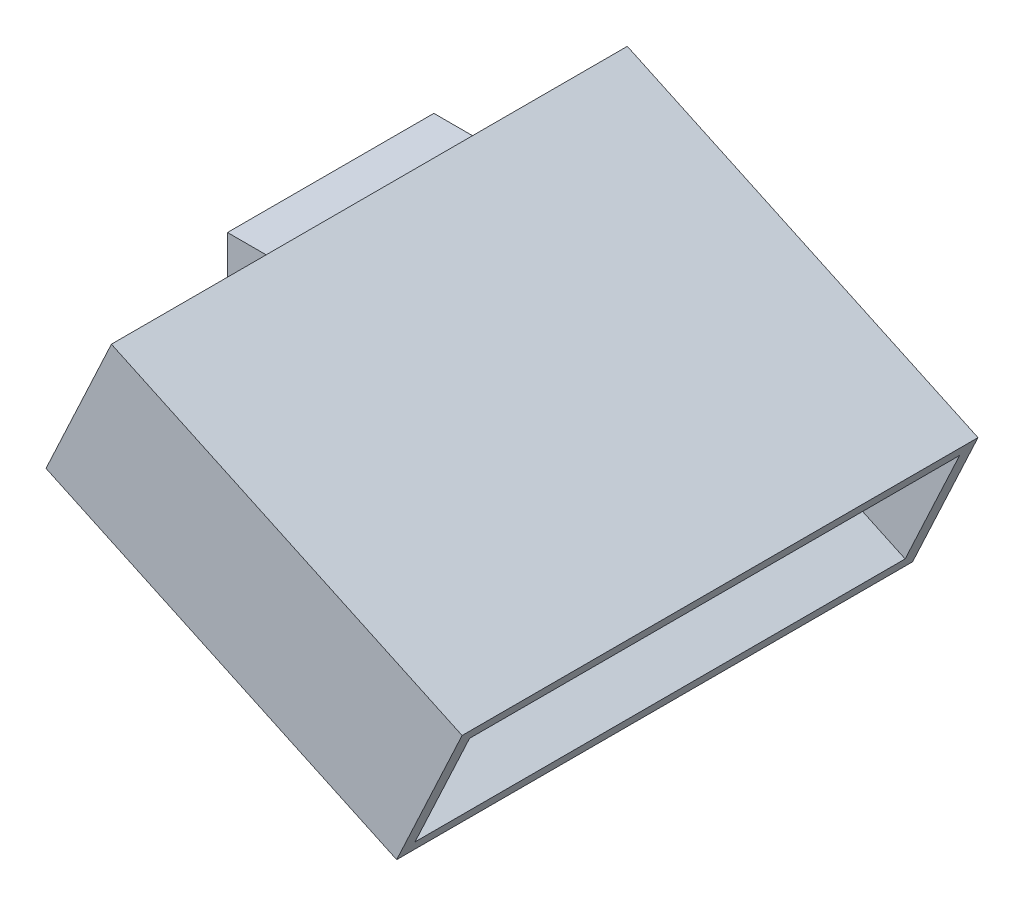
ISO-10303-21;
HEADER;
FILE_DESCRIPTION(('STEP AP214'),'2;1');
FILE_NAME('part.step','',(''),(''),'','','');
FILE_SCHEMA(('AUTOMOTIVE_DESIGN { 1 0 10303 214 1 1 1 1 }'));
ENDSEC;
DATA;
#1=APPLICATION_CONTEXT('core data for automotive mechanical design processes');
#2=APPLICATION_PROTOCOL_DEFINITION('international standard','automotive_design',2000,#1);
#3=PRODUCT_CONTEXT('',#1,'mechanical');
#4=PRODUCT('Part','Part','',(#3));
#5=PRODUCT_RELATED_PRODUCT_CATEGORY('part','',(#4));
#6=PRODUCT_DEFINITION_FORMATION('','',#4);
#7=PRODUCT_DEFINITION_CONTEXT('part definition',#1,'design');
#8=PRODUCT_DEFINITION('design','',#6,#7);
#9=PRODUCT_DEFINITION_SHAPE('','',#8);
#10=(LENGTH_UNIT() NAMED_UNIT(*) SI_UNIT(.MILLI.,.METRE.));
#11=(NAMED_UNIT(*) PLANE_ANGLE_UNIT() SI_UNIT($,.RADIAN.));
#12=(NAMED_UNIT(*) SI_UNIT($,.STERADIAN.) SOLID_ANGLE_UNIT());
#13=UNCERTAINTY_MEASURE_WITH_UNIT(LENGTH_MEASURE(1.E-05),#10,'distance_accuracy_value','');
#14=(GEOMETRIC_REPRESENTATION_CONTEXT(3) GLOBAL_UNCERTAINTY_ASSIGNED_CONTEXT((#13)) GLOBAL_UNIT_ASSIGNED_CONTEXT((#10,
#11,#12)) REPRESENTATION_CONTEXT('',''));
#15=CARTESIAN_POINT('',(0.,0.,0.));
#16=DIRECTION('',(0.,0.,1.));
#17=DIRECTION('',(1.,0.,0.));
#18=AXIS2_PLACEMENT_3D('',#15,#16,#17);
#19=CARTESIAN_POINT('',(15.,-14.81,-40.));
#20=DIRECTION('',(0.,0.,1.));
#21=DIRECTION('',(1.,0.,0.));
#22=AXIS2_PLACEMENT_3D('',#19,#20,#21);
#23=PLANE('',#22);
#24=DIRECTION('',(0.422618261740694,0.906307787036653,0.));
#25=VECTOR('',#24,1.);
#26=CARTESIAN_POINT('',(3.65488179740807,-9.51968449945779,-40.));
#27=LINE('',#26,#25);
#28=CARTESIAN_POINT('',(1.18796716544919,-14.81,-40.));
#29=VERTEX_POINT('',#28);
#30=CARTESIAN_POINT('',(15.,14.81,-40.));
#31=VERTEX_POINT('',#30);
#32=EDGE_CURVE('E257',#29,#31,#27,.T.);
#33=ORIENTED_EDGE('',*,*,#32,.F.);
#34=DIRECTION('',(-1.,0.,0.));
#35=VECTOR('',#34,1.);
#36=CARTESIAN_POINT('',(15.,-14.81,-40.));
#37=LINE('',#36,#35);
#38=CARTESIAN_POINT('',(0.,-14.81,-40.));
#39=VERTEX_POINT('',#38);
#40=EDGE_CURVE('E283',#29,#39,#37,.T.);
#41=ORIENTED_EDGE('',*,*,#40,.T.);
#42=DIRECTION('',(0.,1.,0.));
#43=VECTOR('',#42,1.);
#44=CARTESIAN_POINT('',(0.,-14.81,-40.));
#45=LINE('',#44,#43);
#46=CARTESIAN_POINT('',(0.,14.81,-40.));
#47=VERTEX_POINT('',#46);
#48=EDGE_CURVE('E279',#39,#47,#45,.T.);
#49=ORIENTED_EDGE('',*,*,#48,.T.);
#50=DIRECTION('',(-1.,0.,0.));
#51=VECTOR('',#50,1.);
#52=CARTESIAN_POINT('',(15.,14.81,-40.));
#53=LINE('',#52,#51);
#54=EDGE_CURVE('E41',#31,#47,#53,.T.);
#55=ORIENTED_EDGE('',*,*,#54,.F.);
#56=EDGE_LOOP('',(#33,#41,#49,#55));
#57=FACE_BOUND('',#56,.T.);
#58=ADVANCED_FACE('F34',(#57),#23,.F.);
#59=CARTESIAN_POINT('',(15.,-14.81,40.));
#60=DIRECTION('',(0.,0.,-1.));
#61=DIRECTION('',(-1.,0.,0.));
#62=AXIS2_PLACEMENT_3D('',#59,#60,#61);
#63=PLANE('',#62);
#64=DIRECTION('',(-0.422618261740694,-0.906307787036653,0.));
#65=VECTOR('',#64,1.);
#66=CARTESIAN_POINT('',(3.65488179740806,-9.51968449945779,40.));
#67=LINE('',#66,#65);
#68=CARTESIAN_POINT('',(15.,14.81,40.));
#69=VERTEX_POINT('',#68);
#70=CARTESIAN_POINT('',(1.18796716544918,-14.81,40.));
#71=VERTEX_POINT('',#70);
#72=EDGE_CURVE('E254',#69,#71,#67,.T.);
#73=ORIENTED_EDGE('',*,*,#72,.F.);
#74=DIRECTION('',(-1.,0.,0.));
#75=VECTOR('',#74,1.);
#76=CARTESIAN_POINT('',(15.,14.81,40.));
#77=LINE('',#76,#75);
#78=CARTESIAN_POINT('',(0.,14.81,40.));
#79=VERTEX_POINT('',#78);
#80=EDGE_CURVE('E297',#69,#79,#77,.T.);
#81=ORIENTED_EDGE('',*,*,#80,.T.);
#82=DIRECTION('',(0.,-1.,0.));
#83=VECTOR('',#82,1.);
#84=CARTESIAN_POINT('',(0.,-14.81,40.));
#85=LINE('',#84,#83);
#86=CARTESIAN_POINT('',(0.,-14.81,40.));
#87=VERTEX_POINT('',#86);
#88=EDGE_CURVE('E289',#79,#87,#85,.T.);
#89=ORIENTED_EDGE('',*,*,#88,.T.);
#90=DIRECTION('',(-1.,0.,0.));
#91=VECTOR('',#90,1.);
#92=CARTESIAN_POINT('',(15.,-14.81,40.));
#93=LINE('',#92,#91);
#94=EDGE_CURVE('E295',#71,#87,#93,.T.);
#95=ORIENTED_EDGE('',*,*,#94,.F.);
#96=EDGE_LOOP('',(#73,#81,#89,#95));
#97=FACE_BOUND('',#96,.T.);
#98=ADVANCED_FACE('F314',(#97),#63,.F.);
#99=CARTESIAN_POINT('',(15.,-14.81,40.));
#100=DIRECTION('',(0.,1.,0.));
#101=DIRECTION('',(0.,0.,1.));
#102=AXIS2_PLACEMENT_3D('',#99,#100,#101);
#103=PLANE('',#102);
#104=DIRECTION('',(0.,0.,-1.));
#105=VECTOR('',#104,1.);
#106=CARTESIAN_POINT('',(1.18796716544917,-14.81,40.));
#107=LINE('',#106,#105);
#108=EDGE_CURVE('E251',#71,#29,#107,.T.);
#109=ORIENTED_EDGE('',*,*,#108,.F.);
#110=ORIENTED_EDGE('',*,*,#94,.T.);
#111=DIRECTION('',(0.,0.,-1.));
#112=VECTOR('',#111,1.);
#113=CARTESIAN_POINT('',(0.,-14.81,40.));
#114=LINE('',#113,#112);
#115=EDGE_CURVE('E284',#87,#39,#114,.T.);
#116=ORIENTED_EDGE('',*,*,#115,.T.);
#117=ORIENTED_EDGE('',*,*,#40,.F.);
#118=EDGE_LOOP('',(#109,#110,#116,#117));
#119=FACE_BOUND('',#118,.T.);
#120=ADVANCED_FACE('F337',(#119),#103,.F.);
#121=CARTESIAN_POINT('',(15.,-9.81,-35.));
#122=DIRECTION('',(0.,0.,1.));
#123=DIRECTION('',(1.,0.,0.));
#124=AXIS2_PLACEMENT_3D('',#121,#122,#123);
#125=PLANE('',#124);
#126=DIRECTION('',(-1.,0.,0.));
#127=VECTOR('',#126,1.);
#128=CARTESIAN_POINT('',(15.,-9.81,-35.));
#129=LINE('',#128,#127);
#130=CARTESIAN_POINT('',(3.51950545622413,-9.81,-35.));
#131=VERTEX_POINT('',#130);
#132=CARTESIAN_POINT('',(0.,-9.81,-35.));
#133=VERTEX_POINT('',#132);
#134=EDGE_CURVE('E171',#131,#133,#129,.T.);
#135=ORIENTED_EDGE('',*,*,#134,.F.);
#136=DIRECTION('',(-0.906307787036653,0.422618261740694,0.));
#137=VECTOR('',#136,1.);
#138=CARTESIAN_POINT('',(160.295039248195,-82.9156320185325,-35.));
#139=LINE('',#138,#137);
#140=CARTESIAN_POINT('',(8.05104439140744,-11.9230913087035,-35.));
#141=VERTEX_POINT('',#140);
#142=EDGE_CURVE('E159',#141,#131,#139,.T.);
#143=ORIENTED_EDGE('',*,*,#142,.F.);
#144=DIRECTION('',(-0.422618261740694,-0.906307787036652,0.));
#145=VECTOR('',#144,1.);
#146=CARTESIAN_POINT('',(17.2000006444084,7.69690869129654,-35.));
#147=LINE('',#146,#145);
#148=CARTESIAN_POINT('',(17.2000006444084,7.69690869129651,-35.));
#149=VERTEX_POINT('',#148);
#150=EDGE_CURVE('E168',#149,#141,#147,.T.);
#151=ORIENTED_EDGE('',*,*,#150,.F.);
#152=DIRECTION('',(-0.906307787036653,0.422618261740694,0.));
#153=VECTOR('',#152,1.);
#154=CARTESIAN_POINT('',(169.443995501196,-63.2956320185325,-35.));
#155=LINE('',#154,#153);
#156=CARTESIAN_POINT('',(12.6684617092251,9.81,-35.));
#157=VERTEX_POINT('',#156);
#158=EDGE_CURVE('E163',#149,#157,#155,.T.);
#159=ORIENTED_EDGE('',*,*,#158,.T.);
#160=DIRECTION('',(-1.,0.,0.));
#161=VECTOR('',#160,1.);
#162=CARTESIAN_POINT('',(15.,9.81,-35.));
#163=LINE('',#162,#161);
#164=CARTESIAN_POINT('',(0.,9.81,-35.));
#165=VERTEX_POINT('',#164);
#166=EDGE_CURVE('E277',#157,#165,#163,.T.);
#167=ORIENTED_EDGE('',*,*,#166,.T.);
#168=DIRECTION('',(0.,1.,0.));
#169=VECTOR('',#168,1.);
#170=CARTESIAN_POINT('',(0.,-9.81,-35.));
#171=LINE('',#170,#169);
#172=EDGE_CURVE('E260',#133,#165,#171,.T.);
#173=ORIENTED_EDGE('',*,*,#172,.F.);
#174=EDGE_LOOP('',(#135,#143,#151,#159,#167,#173));
#175=FACE_BOUND('',#174,.T.);
#176=ADVANCED_FACE('F167',(#175),#125,.T.);
#177=CARTESIAN_POINT('',(15.,9.81,35.));
#178=DIRECTION('',(0.,-1.,0.));
#179=DIRECTION('',(0.,0.,-1.));
#180=AXIS2_PLACEMENT_3D('',#177,#178,#179);
#181=PLANE('',#180);
#182=ORIENTED_EDGE('',*,*,#166,.F.);
#183=DIRECTION('',(0.,0.,1.));
#184=VECTOR('',#183,1.);
#185=CARTESIAN_POINT('',(12.6684617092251,9.81,35.));
#186=LINE('',#185,#184);
#187=CARTESIAN_POINT('',(12.6684617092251,9.81000000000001,35.));
#188=VERTEX_POINT('',#187);
#189=EDGE_CURVE('E248',#157,#188,#186,.T.);
#190=ORIENTED_EDGE('',*,*,#189,.T.);
#191=DIRECTION('',(-1.,0.,0.));
#192=VECTOR('',#191,1.);
#193=CARTESIAN_POINT('',(15.,9.81,35.));
#194=LINE('',#193,#192);
#195=CARTESIAN_POINT('',(0.,9.81,35.));
#196=VERTEX_POINT('',#195);
#197=EDGE_CURVE('E275',#188,#196,#194,.T.);
#198=ORIENTED_EDGE('',*,*,#197,.T.);
#199=DIRECTION('',(0.,0.,1.));
#200=VECTOR('',#199,1.);
#201=CARTESIAN_POINT('',(0.,9.81,35.));
#202=LINE('',#201,#200);
#203=EDGE_CURVE('E263',#165,#196,#202,.T.);
#204=ORIENTED_EDGE('',*,*,#203,.F.);
#205=EDGE_LOOP('',(#182,#190,#198,#204));
#206=FACE_BOUND('',#205,.T.);
#207=ADVANCED_FACE('F344',(#206),#181,.T.);
#208=CARTESIAN_POINT('',(15.,-9.81,35.));
#209=DIRECTION('',(0.,0.,-1.));
#210=DIRECTION('',(-1.,0.,0.));
#211=AXIS2_PLACEMENT_3D('',#208,#209,#210);
#212=PLANE('',#211);
#213=ORIENTED_EDGE('',*,*,#197,.F.);
#214=DIRECTION('',(-0.906307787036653,0.422618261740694,0.));
#215=VECTOR('',#214,1.);
#216=CARTESIAN_POINT('',(169.443995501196,-63.2956320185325,35.));
#217=LINE('',#216,#215);
#218=CARTESIAN_POINT('',(17.2000006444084,7.69690869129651,35.));
#219=VERTEX_POINT('',#218);
#220=EDGE_CURVE('E183',#219,#188,#217,.T.);
#221=ORIENTED_EDGE('',*,*,#220,.F.);
#222=DIRECTION('',(0.422618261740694,0.906307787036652,0.));
#223=VECTOR('',#222,1.);
#224=CARTESIAN_POINT('',(17.2000006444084,7.69690869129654,35.));
#225=LINE('',#224,#223);
#226=CARTESIAN_POINT('',(8.05104439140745,-11.9230913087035,35.));
#227=VERTEX_POINT('',#226);
#228=EDGE_CURVE('E178',#227,#219,#225,.T.);
#229=ORIENTED_EDGE('',*,*,#228,.F.);
#230=DIRECTION('',(-0.906307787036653,0.422618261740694,0.));
#231=VECTOR('',#230,1.);
#232=CARTESIAN_POINT('',(160.295039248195,-82.9156320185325,35.));
#233=LINE('',#232,#231);
#234=CARTESIAN_POINT('',(3.51950545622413,-9.81,35.));
#235=VERTEX_POINT('',#234);
#236=EDGE_CURVE('E48',#227,#235,#233,.T.);
#237=ORIENTED_EDGE('',*,*,#236,.T.);
#238=DIRECTION('',(-1.,0.,0.));
#239=VECTOR('',#238,1.);
#240=CARTESIAN_POINT('',(15.,-9.81,35.));
#241=LINE('',#240,#239);
#242=CARTESIAN_POINT('',(0.,-9.81,35.));
#243=VERTEX_POINT('',#242);
#244=EDGE_CURVE('E273',#235,#243,#241,.T.);
#245=ORIENTED_EDGE('',*,*,#244,.T.);
#246=DIRECTION('',(0.,-1.,0.));
#247=VECTOR('',#246,1.);
#248=CARTESIAN_POINT('',(0.,-9.81,35.));
#249=LINE('',#248,#247);
#250=EDGE_CURVE('E266',#196,#243,#249,.T.);
#251=ORIENTED_EDGE('',*,*,#250,.F.);
#252=EDGE_LOOP('',(#213,#221,#229,#237,#245,#251));
#253=FACE_BOUND('',#252,.T.);
#254=ADVANCED_FACE('F479',(#253),#212,.T.);
#255=CARTESIAN_POINT('',(15.,-9.81,35.));
#256=DIRECTION('',(0.,1.,0.));
#257=DIRECTION('',(0.,0.,1.));
#258=AXIS2_PLACEMENT_3D('',#255,#256,#257);
#259=PLANE('',#258);
#260=ORIENTED_EDGE('',*,*,#244,.F.);
#261=DIRECTION('',(0.,0.,-1.));
#262=VECTOR('',#261,1.);
#263=CARTESIAN_POINT('',(3.51950545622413,-9.81,35.));
#264=LINE('',#263,#262);
#265=EDGE_CURVE('E11',#235,#131,#264,.T.);
#266=ORIENTED_EDGE('',*,*,#265,.T.);
#267=ORIENTED_EDGE('',*,*,#134,.T.);
#268=DIRECTION('',(0.,0.,-1.));
#269=VECTOR('',#268,1.);
#270=CARTESIAN_POINT('',(0.,-9.81,35.));
#271=LINE('',#270,#269);
#272=EDGE_CURVE('E269',#243,#133,#271,.T.);
#273=ORIENTED_EDGE('',*,*,#272,.F.);
#274=EDGE_LOOP('',(#260,#266,#267,#273));
#275=FACE_BOUND('',#274,.T.);
#276=ADVANCED_FACE('F489',(#275),#259,.T.);
#277=CARTESIAN_POINT('',(0.,0.,0.));
#278=DIRECTION('',(-1.,0.,0.));
#279=DIRECTION('',(0.,0.,1.));
#280=AXIS2_PLACEMENT_3D('',#277,#278,#279);
#281=PLANE('',#280);
#282=ORIENTED_EDGE('',*,*,#48,.F.);
#283=ORIENTED_EDGE('',*,*,#115,.F.);
#284=ORIENTED_EDGE('',*,*,#88,.F.);
#285=DIRECTION('',(0.,0.,1.));
#286=VECTOR('',#285,1.);
#287=CARTESIAN_POINT('',(0.,14.81,40.));
#288=LINE('',#287,#286);
#289=EDGE_CURVE('E287',#47,#79,#288,.T.);
#290=ORIENTED_EDGE('',*,*,#289,.F.);
#291=EDGE_LOOP('',(#282,#283,#284,#290));
#292=FACE_BOUND('',#291,.T.);
#293=ORIENTED_EDGE('',*,*,#272,.T.);
#294=ORIENTED_EDGE('',*,*,#172,.T.);
#295=ORIENTED_EDGE('',*,*,#203,.T.);
#296=ORIENTED_EDGE('',*,*,#250,.T.);
#297=EDGE_LOOP('',(#293,#294,#295,#296));
#298=FACE_BOUND('',#297,.T.);
#299=ADVANCED_FACE('F309',(#292,#298),#281,.T.);
#300=CARTESIAN_POINT('',(15.,14.81,40.));
#301=DIRECTION('',(0.,-1.,0.));
#302=DIRECTION('',(0.,0.,-1.));
#303=AXIS2_PLACEMENT_3D('',#300,#301,#302);
#304=PLANE('',#303);
#305=ORIENTED_EDGE('',*,*,#289,.T.);
#306=ORIENTED_EDGE('',*,*,#80,.F.);
#307=DIRECTION('',(0.,0.,1.));
#308=VECTOR('',#307,1.);
#309=CARTESIAN_POINT('',(15.,14.81,40.));
#310=LINE('',#309,#308);
#311=EDGE_CURVE('E280',#31,#69,#310,.T.);
#312=ORIENTED_EDGE('',*,*,#311,.F.);
#313=ORIENTED_EDGE('',*,*,#54,.T.);
#314=EDGE_LOOP('',(#305,#306,#312,#313));
#315=FACE_BOUND('',#314,.T.);
#316=ADVANCED_FACE('F302',(#315),#304,.F.);
#317=CARTESIAN_POINT('',(-10.3570957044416,-39.5684672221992,100.));
#318=DIRECTION('',(0.906307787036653,-0.422618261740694,0.));
#319=DIRECTION('',(0.422618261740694,0.906307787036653,0.));
#320=AXIS2_PLACEMENT_3D('',#317,#318,#319);
#321=PLANE('',#320);
#322=ORIENTED_EDGE('',*,*,#108,.T.);
#323=ORIENTED_EDGE('',*,*,#32,.T.);
#324=DIRECTION('',(0.,0.,-1.));
#325=VECTOR('',#324,1.);
#326=CARTESIAN_POINT('',(15.,14.81,100.));
#327=LINE('',#326,#325);
#328=CARTESIAN_POINT('',(15.,14.81,-100.));
#329=VERTEX_POINT('',#328);
#330=EDGE_CURVE('E230',#31,#329,#327,.T.);
#331=ORIENTED_EDGE('',*,*,#330,.T.);
#332=DIRECTION('',(0.422618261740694,0.906307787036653,0.));
#333=VECTOR('',#332,1.);
#334=CARTESIAN_POINT('',(-10.3570957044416,-39.5684672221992,-100.));
#335=LINE('',#334,#333);
#336=CARTESIAN_POINT('',(-10.3570957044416,-39.5684672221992,-100.));
#337=VERTEX_POINT('',#336);
#338=EDGE_CURVE('E242',#337,#329,#335,.T.);
#339=ORIENTED_EDGE('',*,*,#338,.F.);
#340=DIRECTION('',(0.,0.,-1.));
#341=VECTOR('',#340,1.);
#342=CARTESIAN_POINT('',(-10.3570957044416,-39.5684672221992,100.));
#343=LINE('',#342,#341);
#344=CARTESIAN_POINT('',(-10.3570957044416,-39.5684672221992,100.));
#345=VERTEX_POINT('',#344);
#346=EDGE_CURVE('E220',#345,#337,#343,.T.);
#347=ORIENTED_EDGE('',*,*,#346,.F.);
#348=DIRECTION('',(0.422618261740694,0.906307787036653,0.));
#349=VECTOR('',#348,1.);
#350=CARTESIAN_POINT('',(-10.3570957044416,-39.5684672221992,100.));
#351=LINE('',#350,#349);
#352=CARTESIAN_POINT('',(15.,14.81,100.));
#353=VERTEX_POINT('',#352);
#354=EDGE_CURVE('E245',#345,#353,#351,.T.);
#355=ORIENTED_EDGE('',*,*,#354,.T.);
#356=EDGE_CURVE('E231',#353,#69,#327,.T.);
#357=ORIENTED_EDGE('',*,*,#356,.T.);
#358=ORIENTED_EDGE('',*,*,#72,.T.);
#359=EDGE_LOOP('',(#322,#323,#331,#339,#347,#355,#357,#358));
#360=FACE_BOUND('',#359,.T.);
#361=ADVANCED_FACE('F321',(#360),#321,.F.);
#362=CARTESIAN_POINT('',(-10.3570957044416,-39.5684672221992,100.));
#363=DIRECTION('',(0.,0.,-1.));
#364=DIRECTION('',(-1.,0.,0.));
#365=AXIS2_PLACEMENT_3D('',#362,#363,#364);
#366=PLANE('',#365);
#367=DIRECTION('',(-0.906307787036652,0.422618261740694,0.));
#368=VECTOR('',#367,1.);
#369=CARTESIAN_POINT('',(15.,14.81,100.));
#370=LINE('',#369,#368);
#371=CARTESIAN_POINT('',(150.946168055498,-48.5827392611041,100.));
#372=VERTEX_POINT('',#371);
#373=EDGE_CURVE('E211',#372,#353,#370,.T.);
#374=ORIENTED_EDGE('',*,*,#373,.T.);
#375=ORIENTED_EDGE('',*,*,#354,.F.);
#376=DIRECTION('',(-0.906307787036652,0.422618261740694,0.));
#377=VECTOR('',#376,1.);
#378=CARTESIAN_POINT('',(-10.3570957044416,-39.5684672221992,100.));
#379=LINE('',#378,#377);
#380=CARTESIAN_POINT('',(125.589072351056,-102.961206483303,100.));
#381=VERTEX_POINT('',#380);
#382=EDGE_CURVE('E217',#381,#345,#379,.T.);
#383=ORIENTED_EDGE('',*,*,#382,.F.);
#384=DIRECTION('',(0.422618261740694,0.906307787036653,0.));
#385=VECTOR('',#384,1.);
#386=CARTESIAN_POINT('',(125.589072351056,-102.961206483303,100.));
#387=LINE('',#386,#385);
#388=EDGE_CURVE('E227',#381,#372,#387,.T.);
#389=ORIENTED_EDGE('',*,*,#388,.T.);
#390=EDGE_LOOP('',(#374,#375,#383,#389));
#391=FACE_BOUND('',#390,.T.);
#392=ADVANCED_FACE('F326',(#391),#366,.F.);
#393=CARTESIAN_POINT('',(-10.3570957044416,-39.5684672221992,-100.));
#394=DIRECTION('',(0.,0.,1.));
#395=DIRECTION('',(1.,0.,0.));
#396=AXIS2_PLACEMENT_3D('',#393,#394,#395);
#397=PLANE('',#396);
#398=DIRECTION('',(0.906307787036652,-0.422618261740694,0.));
#399=VECTOR('',#398,1.);
#400=CARTESIAN_POINT('',(15.,14.81,-100.));
#401=LINE('',#400,#399);
#402=CARTESIAN_POINT('',(150.946168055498,-48.5827392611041,-100.));
#403=VERTEX_POINT('',#402);
#404=EDGE_CURVE('E234',#329,#403,#401,.T.);
#405=ORIENTED_EDGE('',*,*,#404,.T.);
#406=DIRECTION('',(0.422618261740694,0.906307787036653,0.));
#407=VECTOR('',#406,1.);
#408=CARTESIAN_POINT('',(125.589072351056,-102.961206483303,-100.));
#409=LINE('',#408,#407);
#410=CARTESIAN_POINT('',(125.589072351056,-102.961206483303,-100.));
#411=VERTEX_POINT('',#410);
#412=EDGE_CURVE('E239',#411,#403,#409,.T.);
#413=ORIENTED_EDGE('',*,*,#412,.F.);
#414=DIRECTION('',(0.906307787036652,-0.422618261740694,0.));
#415=VECTOR('',#414,1.);
#416=CARTESIAN_POINT('',(-10.3570957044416,-39.5684672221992,-100.));
#417=LINE('',#416,#415);
#418=EDGE_CURVE('E223',#337,#411,#417,.T.);
#419=ORIENTED_EDGE('',*,*,#418,.F.);
#420=ORIENTED_EDGE('',*,*,#338,.T.);
#421=EDGE_LOOP('',(#405,#413,#419,#420));
#422=FACE_BOUND('',#421,.T.);
#423=ADVANCED_FACE('F335',(#422),#397,.F.);
#424=CARTESIAN_POINT('',(125.589072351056,-102.961206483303,100.));
#425=DIRECTION('',(-0.906307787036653,0.422618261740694,0.));
#426=DIRECTION('',(-0.422618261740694,-0.906307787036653,0.));
#427=AXIS2_PLACEMENT_3D('',#424,#425,#426);
#428=PLANE('',#427);
#429=DIRECTION('',(0.,0.,-1.));
#430=VECTOR('',#429,1.);
#431=CARTESIAN_POINT('',(127.70216365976,-98.42966754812,95.));
#432=LINE('',#431,#430);
#433=CARTESIAN_POINT('',(127.70216365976,-98.42966754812,95.));
#434=VERTEX_POINT('',#433);
#435=CARTESIAN_POINT('',(127.70216365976,-98.42966754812,-95.));
#436=VERTEX_POINT('',#435);
#437=EDGE_CURVE('E201',#434,#436,#432,.T.);
#438=ORIENTED_EDGE('',*,*,#437,.F.);
#439=DIRECTION('',(-0.422618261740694,-0.906307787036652,0.));
#440=VECTOR('',#439,1.);
#441=CARTESIAN_POINT('',(148.833076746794,-53.1142781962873,95.));
#442=LINE('',#441,#440);
#443=CARTESIAN_POINT('',(148.833076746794,-53.1142781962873,95.));
#444=VERTEX_POINT('',#443);
#445=EDGE_CURVE('E56',#444,#434,#442,.T.);
#446=ORIENTED_EDGE('',*,*,#445,.F.);
#447=DIRECTION('',(0.,0.,1.));
#448=VECTOR('',#447,1.);
#449=CARTESIAN_POINT('',(148.833076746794,-53.1142781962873,95.));
#450=LINE('',#449,#448);
#451=CARTESIAN_POINT('',(148.833076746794,-53.1142781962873,-95.));
#452=VERTEX_POINT('',#451);
#453=EDGE_CURVE('E190',#452,#444,#450,.T.);
#454=ORIENTED_EDGE('',*,*,#453,.F.);
#455=DIRECTION('',(0.422618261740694,0.906307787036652,0.));
#456=VECTOR('',#455,1.);
#457=CARTESIAN_POINT('',(148.833076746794,-53.1142781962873,-95.));
#458=LINE('',#457,#456);
#459=EDGE_CURVE('E204',#436,#452,#458,.T.);
#460=ORIENTED_EDGE('',*,*,#459,.F.);
#461=EDGE_LOOP('',(#438,#446,#454,#460));
#462=FACE_BOUND('',#461,.T.);
#463=DIRECTION('',(0.,0.,1.));
#464=VECTOR('',#463,1.);
#465=CARTESIAN_POINT('',(150.946168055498,-48.5827392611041,100.));
#466=LINE('',#465,#464);
#467=EDGE_CURVE('E221',#403,#372,#466,.T.);
#468=ORIENTED_EDGE('',*,*,#467,.T.);
#469=ORIENTED_EDGE('',*,*,#388,.F.);
#470=DIRECTION('',(0.,0.,1.));
#471=VECTOR('',#470,1.);
#472=CARTESIAN_POINT('',(125.589072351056,-102.961206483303,100.));
#473=LINE('',#472,#471);
#474=EDGE_CURVE('E225',#411,#381,#473,.T.);
#475=ORIENTED_EDGE('',*,*,#474,.F.);
#476=ORIENTED_EDGE('',*,*,#412,.T.);
#477=EDGE_LOOP('',(#468,#469,#475,#476));
#478=FACE_BOUND('',#477,.T.);
#479=ADVANCED_FACE('F330',(#462,#478),#428,.F.);
#480=CARTESIAN_POINT('',(-17.0054436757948,-36.468291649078,0.));
#481=DIRECTION('',(0.422618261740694,0.906307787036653,0.));
#482=DIRECTION('',(-0.906307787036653,0.422618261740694,0.));
#483=AXIS2_PLACEMENT_3D('',#480,#481,#482);
#484=PLANE('',#483);
#485=ORIENTED_EDGE('',*,*,#382,.T.);
#486=ORIENTED_EDGE('',*,*,#346,.T.);
#487=ORIENTED_EDGE('',*,*,#418,.T.);
#488=ORIENTED_EDGE('',*,*,#474,.T.);
#489=EDGE_LOOP('',(#485,#486,#487,#488));
#490=FACE_BOUND('',#489,.T.);
#491=ADVANCED_FACE('F402',(#490),#484,.F.);
#492=CARTESIAN_POINT('',(8.35165202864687,17.9101755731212,0.));
#493=DIRECTION('',(0.422618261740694,0.906307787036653,0.));
#494=DIRECTION('',(-0.906307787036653,0.422618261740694,0.));
#495=AXIS2_PLACEMENT_3D('',#492,#493,#494);
#496=PLANE('',#495);
#497=ORIENTED_EDGE('',*,*,#373,.F.);
#498=ORIENTED_EDGE('',*,*,#467,.F.);
#499=ORIENTED_EDGE('',*,*,#404,.F.);
#500=ORIENTED_EDGE('',*,*,#330,.F.);
#501=ORIENTED_EDGE('',*,*,#311,.T.);
#502=ORIENTED_EDGE('',*,*,#356,.F.);
#503=EDGE_LOOP('',(#497,#498,#499,#500,#501,#502));
#504=FACE_BOUND('',#503,.T.);
#505=ADVANCED_FACE('F318',(#504),#496,.T.);
#506=CARTESIAN_POINT('',(17.4184476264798,8.16536975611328,95.));
#507=DIRECTION('',(0.,0.,1.));
#508=DIRECTION('',(1.,0.,0.));
#509=AXIS2_PLACEMENT_3D('',#506,#507,#508);
#510=PLANE('',#509);
#511=ORIENTED_EDGE('',*,*,#445,.T.);
#512=DIRECTION('',(0.906307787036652,-0.422618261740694,0.));
#513=VECTOR('',#512,1.);
#514=CARTESIAN_POINT('',(-3.71246546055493,-37.1500195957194,95.));
#515=LINE('',#514,#513);
#516=CARTESIAN_POINT('',(-3.71246546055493,-37.1500195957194,95.));
#517=VERTEX_POINT('',#516);
#518=EDGE_CURVE('E199',#517,#434,#515,.T.);
#519=ORIENTED_EDGE('',*,*,#518,.F.);
#520=DIRECTION('',(-0.422618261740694,-0.906307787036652,0.));
#521=VECTOR('',#520,1.);
#522=CARTESIAN_POINT('',(17.4184476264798,8.16536975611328,95.));
#523=LINE('',#522,#521);
#524=CARTESIAN_POINT('',(17.4184476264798,8.16536975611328,95.));
#525=VERTEX_POINT('',#524);
#526=EDGE_CURVE('E186',#525,#517,#523,.T.);
#527=ORIENTED_EDGE('',*,*,#526,.F.);
#528=DIRECTION('',(0.906307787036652,-0.422618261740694,0.));
#529=VECTOR('',#528,1.);
#530=CARTESIAN_POINT('',(17.4184476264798,8.16536975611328,95.));
#531=LINE('',#530,#529);
#532=EDGE_CURVE('E209',#525,#444,#531,.T.);
#533=ORIENTED_EDGE('',*,*,#532,.T.);
#534=EDGE_LOOP('',(#511,#519,#527,#533));
#535=FACE_BOUND('',#534,.T.);
#536=ADVANCED_FACE('F416',(#535),#510,.F.);
#537=CARTESIAN_POINT('',(17.4184476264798,8.16536975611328,95.));
#538=DIRECTION('',(0.422618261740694,0.906307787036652,0.));
#539=DIRECTION('',(-0.906307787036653,0.422618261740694,0.));
#540=AXIS2_PLACEMENT_3D('',#537,#538,#539);
#541=PLANE('',#540);
#542=ORIENTED_EDGE('',*,*,#453,.T.);
#543=ORIENTED_EDGE('',*,*,#532,.F.);
#544=DIRECTION('',(0.,0.,1.));
#545=VECTOR('',#544,1.);
#546=CARTESIAN_POINT('',(17.4184476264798,8.16536975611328,95.));
#547=LINE('',#546,#545);
#548=CARTESIAN_POINT('',(17.4184476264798,8.16536975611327,-95.));
#549=VERTEX_POINT('',#548);
#550=EDGE_CURVE('E196',#549,#525,#547,.T.);
#551=ORIENTED_EDGE('',*,*,#550,.F.);
#552=DIRECTION('',(0.906307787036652,-0.422618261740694,0.));
#553=VECTOR('',#552,1.);
#554=CARTESIAN_POINT('',(17.4184476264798,8.16536975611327,-95.));
#555=LINE('',#554,#553);
#556=EDGE_CURVE('E212',#549,#452,#555,.T.);
#557=ORIENTED_EDGE('',*,*,#556,.T.);
#558=EDGE_LOOP('',(#542,#543,#551,#557));
#559=FACE_BOUND('',#558,.T.);
#560=ADVANCED_FACE('F432',(#559),#541,.F.);
#561=CARTESIAN_POINT('',(17.4184476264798,8.16536975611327,-95.));
#562=DIRECTION('',(0.,0.,-1.));
#563=DIRECTION('',(-1.,0.,0.));
#564=AXIS2_PLACEMENT_3D('',#561,#562,#563);
#565=PLANE('',#564);
#566=ORIENTED_EDGE('',*,*,#459,.T.);
#567=ORIENTED_EDGE('',*,*,#556,.F.);
#568=DIRECTION('',(0.422618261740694,0.906307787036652,0.));
#569=VECTOR('',#568,1.);
#570=CARTESIAN_POINT('',(17.4184476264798,8.16536975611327,-95.));
#571=LINE('',#570,#569);
#572=CARTESIAN_POINT('',(-3.7124654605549,-37.1500195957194,-95.));
#573=VERTEX_POINT('',#572);
#574=EDGE_CURVE('E193',#573,#549,#571,.T.);
#575=ORIENTED_EDGE('',*,*,#574,.F.);
#576=DIRECTION('',(0.906307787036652,-0.422618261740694,0.));
#577=VECTOR('',#576,1.);
#578=CARTESIAN_POINT('',(-3.7124654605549,-37.1500195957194,-95.));
#579=LINE('',#578,#577);
#580=EDGE_CURVE('E214',#573,#436,#579,.T.);
#581=ORIENTED_EDGE('',*,*,#580,.T.);
#582=EDGE_LOOP('',(#566,#567,#575,#581));
#583=FACE_BOUND('',#582,.T.);
#584=ADVANCED_FACE('F441',(#583),#565,.F.);
#585=CARTESIAN_POINT('',(-3.71246546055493,-37.1500195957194,95.));
#586=DIRECTION('',(-0.422618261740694,-0.906307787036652,0.));
#587=DIRECTION('',(0.906307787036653,-0.422618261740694,0.));
#588=AXIS2_PLACEMENT_3D('',#585,#586,#587);
#589=PLANE('',#588);
#590=ORIENTED_EDGE('',*,*,#437,.T.);
#591=ORIENTED_EDGE('',*,*,#580,.F.);
#592=DIRECTION('',(0.,0.,-1.));
#593=VECTOR('',#592,1.);
#594=CARTESIAN_POINT('',(-3.71246546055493,-37.1500195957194,95.));
#595=LINE('',#594,#593);
#596=EDGE_CURVE('E189',#517,#573,#595,.T.);
#597=ORIENTED_EDGE('',*,*,#596,.F.);
#598=ORIENTED_EDGE('',*,*,#518,.T.);
#599=EDGE_LOOP('',(#590,#591,#597,#598));
#600=FACE_BOUND('',#599,.T.);
#601=ADVANCED_FACE('F451',(#600),#589,.F.);
#602=CARTESIAN_POINT('',(11.1798869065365,-5.21326688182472,0.));
#603=DIRECTION('',(0.906307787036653,-0.422618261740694,0.));
#604=DIRECTION('',(0.422618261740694,0.906307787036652,0.));
#605=AXIS2_PLACEMENT_3D('',#602,#603,#604);
#606=PLANE('',#605);
#607=ORIENTED_EDGE('',*,*,#150,.T.);
#608=DIRECTION('',(0.,0.,1.));
#609=VECTOR('',#608,1.);
#610=CARTESIAN_POINT('',(8.05104439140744,-11.9230913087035,-35.));
#611=LINE('',#610,#609);
#612=EDGE_CURVE('E156',#141,#227,#611,.T.);
#613=ORIENTED_EDGE('',*,*,#612,.T.);
#614=ORIENTED_EDGE('',*,*,#228,.T.);
#615=DIRECTION('',(0.,0.,-1.));
#616=VECTOR('',#615,1.);
#617=CARTESIAN_POINT('',(17.2000006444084,7.69690869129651,-35.));
#618=LINE('',#617,#616);
#619=EDGE_CURVE('E176',#219,#149,#618,.T.);
#620=ORIENTED_EDGE('',*,*,#619,.T.);
#621=EDGE_LOOP('',(#607,#613,#614,#620));
#622=FACE_BOUND('',#621,.T.);
#623=ORIENTED_EDGE('',*,*,#526,.T.);
#624=ORIENTED_EDGE('',*,*,#596,.T.);
#625=ORIENTED_EDGE('',*,*,#574,.T.);
#626=ORIENTED_EDGE('',*,*,#550,.T.);
#627=EDGE_LOOP('',(#623,#624,#625,#626));
#628=FACE_BOUND('',#627,.T.);
#629=ADVANCED_FACE('F174',(#622,#628),#606,.T.);
#630=CARTESIAN_POINT('',(169.443995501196,-63.2956320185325,-35.));
#631=DIRECTION('',(0.422618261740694,0.906307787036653,0.));
#632=DIRECTION('',(-0.906307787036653,0.422618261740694,0.));
#633=AXIS2_PLACEMENT_3D('',#630,#631,#632);
#634=PLANE('',#633);
#635=ORIENTED_EDGE('',*,*,#220,.T.);
#636=ORIENTED_EDGE('',*,*,#189,.F.);
#637=ORIENTED_EDGE('',*,*,#158,.F.);
#638=ORIENTED_EDGE('',*,*,#619,.F.);
#639=EDGE_LOOP('',(#635,#636,#637,#638));
#640=FACE_BOUND('',#639,.T.);
#641=ADVANCED_FACE('F506',(#640),#634,.F.);
#642=CARTESIAN_POINT('',(160.295039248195,-82.9156320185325,-35.));
#643=DIRECTION('',(-0.422618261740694,-0.906307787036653,0.));
#644=DIRECTION('',(0.906307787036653,-0.422618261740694,0.));
#645=AXIS2_PLACEMENT_3D('',#642,#643,#644);
#646=PLANE('',#645);
#647=ORIENTED_EDGE('',*,*,#142,.T.);
#648=ORIENTED_EDGE('',*,*,#265,.F.);
#649=ORIENTED_EDGE('',*,*,#236,.F.);
#650=ORIENTED_EDGE('',*,*,#612,.F.);
#651=EDGE_LOOP('',(#647,#648,#649,#650));
#652=FACE_BOUND('',#651,.T.);
#653=ADVANCED_FACE('F158',(#652),#646,.F.);
#654=CLOSED_SHELL('',(#58,#98,#120,#176,#207,#254,#276,#299,#316,#361,#392,#423,#479,#491,#505,
#536,#560,#584,#601,#629,#641,#653));
#655=MANIFOLD_SOLID_BREP('B2',#654);
#656=ADVANCED_BREP_SHAPE_REPRESENTATION('',(#18,#655),#14);
#657=SHAPE_DEFINITION_REPRESENTATION(#9,#656);
ENDSEC;
END-ISO-10303-21;
